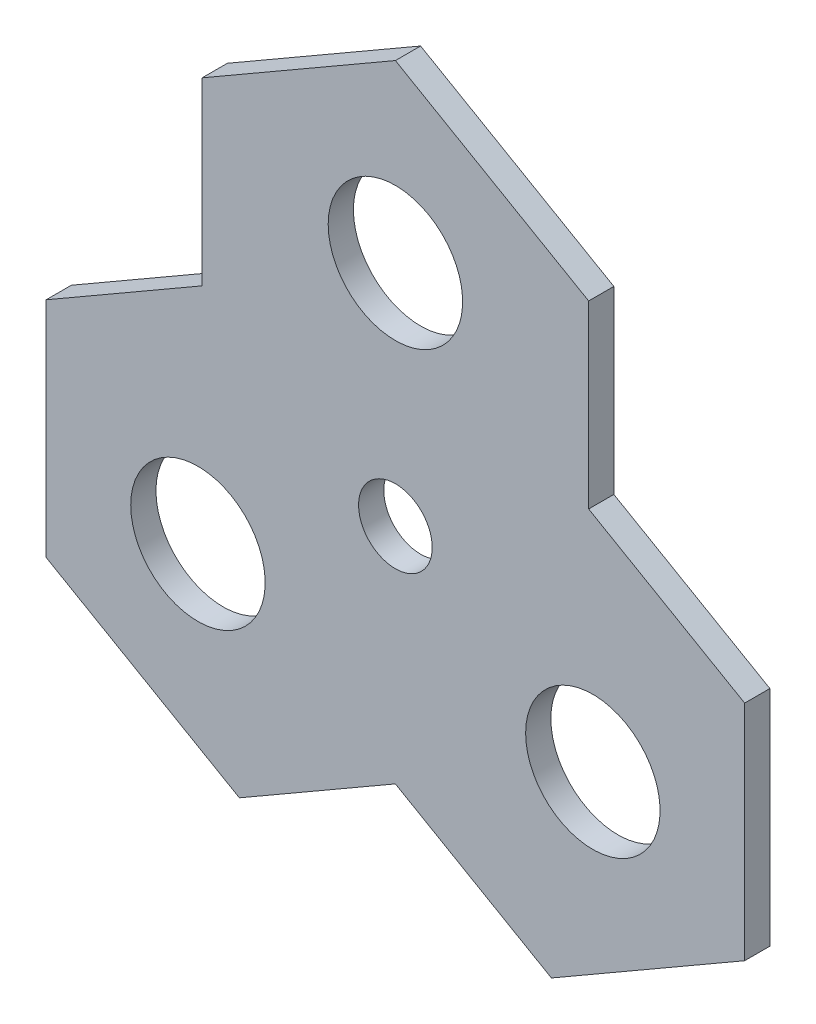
ISO-10303-21;
HEADER;
FILE_DESCRIPTION(('STEP AP214'),'2;1');
FILE_NAME('part.step','',(''),(''),'','','');
FILE_SCHEMA(('AUTOMOTIVE_DESIGN { 1 0 10303 214 1 1 1 1 }'));
ENDSEC;
DATA;
#1=APPLICATION_CONTEXT('core data for automotive mechanical design processes');
#2=APPLICATION_PROTOCOL_DEFINITION('international standard','automotive_design',2000,#1);
#3=PRODUCT_CONTEXT('',#1,'mechanical');
#4=PRODUCT('Part','Part','',(#3));
#5=PRODUCT_RELATED_PRODUCT_CATEGORY('part','',(#4));
#6=PRODUCT_DEFINITION_FORMATION('','',#4);
#7=PRODUCT_DEFINITION_CONTEXT('part definition',#1,'design');
#8=PRODUCT_DEFINITION('design','',#6,#7);
#9=PRODUCT_DEFINITION_SHAPE('','',#8);
#10=(LENGTH_UNIT() NAMED_UNIT(*) SI_UNIT(.MILLI.,.METRE.));
#11=(NAMED_UNIT(*) PLANE_ANGLE_UNIT() SI_UNIT($,.RADIAN.));
#12=(NAMED_UNIT(*) SI_UNIT($,.STERADIAN.) SOLID_ANGLE_UNIT());
#13=UNCERTAINTY_MEASURE_WITH_UNIT(LENGTH_MEASURE(1.E-05),#10,'distance_accuracy_value','');
#14=(GEOMETRIC_REPRESENTATION_CONTEXT(3) GLOBAL_UNCERTAINTY_ASSIGNED_CONTEXT((#13)) GLOBAL_UNIT_ASSIGNED_CONTEXT((#10,
#11,#12)) REPRESENTATION_CONTEXT('',''));
#15=CARTESIAN_POINT('',(0.,0.,0.));
#16=DIRECTION('',(0.,0.,1.));
#17=DIRECTION('',(1.,0.,0.));
#18=AXIS2_PLACEMENT_3D('',#15,#16,#17);
#19=CARTESIAN_POINT('',(-36.5125000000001,63.2415051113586,9.525));
#20=DIRECTION('',(-0.500000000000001,0.866025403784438,0.));
#21=DIRECTION('',(-0.866025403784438,-0.500000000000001,0.));
#22=AXIS2_PLACEMENT_3D('',#19,#20,#21);
#23=PLANE('',#22);
#24=DIRECTION('',(0.866025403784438,0.500000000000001,0.));
#25=VECTOR('',#24,1.);
#26=CARTESIAN_POINT('',(-36.5125000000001,63.2415051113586,0.));
#27=LINE('',#26,#25);
#28=CARTESIAN_POINT('',(-131.982271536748,8.12200681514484,0.));
#29=VERTEX_POINT('',#28);
#30=CARTESIAN_POINT('',(-73.025,42.1610034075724,0.));
#31=VERTEX_POINT('',#30);
#32=EDGE_CURVE('E170',#29,#31,#27,.T.);
#33=ORIENTED_EDGE('',*,*,#32,.F.);
#34=DIRECTION('',(0.,0.,-1.));
#35=VECTOR('',#34,1.);
#36=CARTESIAN_POINT('',(-131.982271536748,8.12200681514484,9.525));
#37=LINE('',#36,#35);
#38=CARTESIAN_POINT('',(-131.982271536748,8.12200681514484,9.525));
#39=VERTEX_POINT('',#38);
#40=EDGE_CURVE('E11',#39,#29,#37,.T.);
#41=ORIENTED_EDGE('',*,*,#40,.F.);
#42=DIRECTION('',(0.866025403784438,0.500000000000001,0.));
#43=VECTOR('',#42,1.);
#44=CARTESIAN_POINT('',(-36.5125000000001,63.2415051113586,9.525));
#45=LINE('',#44,#43);
#46=CARTESIAN_POINT('',(-73.025,42.1610034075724,9.525));
#47=VERTEX_POINT('',#46);
#48=EDGE_CURVE('E432',#39,#47,#45,.T.);
#49=ORIENTED_EDGE('',*,*,#48,.T.);
#50=DIRECTION('',(0.,0.,-1.));
#51=VECTOR('',#50,1.);
#52=CARTESIAN_POINT('',(-73.025,42.1610034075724,9.525));
#53=LINE('',#52,#51);
#54=EDGE_CURVE('E101',#47,#31,#53,.T.);
#55=ORIENTED_EDGE('',*,*,#54,.T.);
#56=EDGE_LOOP('',(#33,#41,#49,#55));
#57=FACE_BOUND('',#56,.T.);
#58=ADVANCED_FACE('F37',(#57),#23,.T.);
#59=CARTESIAN_POINT('',(-131.982271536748,1.30330528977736E-13,9.525));
#60=DIRECTION('',(-1.,0.,0.));
#61=DIRECTION('',(0.,-1.,0.));
#62=AXIS2_PLACEMENT_3D('',#59,#60,#61);
#63=PLANE('',#62);
#64=DIRECTION('',(0.,1.,0.));
#65=VECTOR('',#64,1.);
#66=CARTESIAN_POINT('',(-131.982271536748,1.30330528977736E-13,0.));
#67=LINE('',#66,#65);
#68=CARTESIAN_POINT('',(-131.982271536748,-76.2000000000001,0.));
#69=VERTEX_POINT('',#68);
#70=EDGE_CURVE('E172',#69,#29,#67,.T.);
#71=ORIENTED_EDGE('',*,*,#70,.F.);
#72=DIRECTION('',(0.,0.,-1.));
#73=VECTOR('',#72,1.);
#74=CARTESIAN_POINT('',(-131.982271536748,-76.2000000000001,9.525));
#75=LINE('',#74,#73);
#76=CARTESIAN_POINT('',(-131.982271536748,-76.2000000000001,9.525));
#77=VERTEX_POINT('',#76);
#78=EDGE_CURVE('E46',#77,#69,#75,.T.);
#79=ORIENTED_EDGE('',*,*,#78,.F.);
#80=DIRECTION('',(0.,1.,0.));
#81=VECTOR('',#80,1.);
#82=CARTESIAN_POINT('',(-131.982271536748,1.30330528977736E-13,9.525));
#83=LINE('',#82,#81);
#84=EDGE_CURVE('E230',#77,#39,#83,.T.);
#85=ORIENTED_EDGE('',*,*,#84,.T.);
#86=ORIENTED_EDGE('',*,*,#40,.T.);
#87=EDGE_LOOP('',(#71,#79,#85,#86));
#88=FACE_BOUND('',#87,.T.);
#89=ADVANCED_FACE('F229',(#88),#63,.T.);
#90=CARTESIAN_POINT('',(-65.991135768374,-114.3,9.525));
#91=DIRECTION('',(0.499999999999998,0.86602540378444,0.));
#92=DIRECTION('',(-0.86602540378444,0.499999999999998,0.));
#93=AXIS2_PLACEMENT_3D('',#90,#91,#92);
#94=PLANE('',#93);
#95=DIRECTION('',(0.86602540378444,-0.499999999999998,0.));
#96=VECTOR('',#95,1.);
#97=CARTESIAN_POINT('',(-65.991135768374,-114.3,0.));
#98=LINE('',#97,#96);
#99=CARTESIAN_POINT('',(-58.9572715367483,-118.361003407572,0.));
#100=VERTEX_POINT('',#99);
#101=EDGE_CURVE('E175',#69,#100,#98,.T.);
#102=ORIENTED_EDGE('',*,*,#101,.T.);
#103=DIRECTION('',(0.,0.,-1.));
#104=VECTOR('',#103,1.);
#105=CARTESIAN_POINT('',(-58.9572715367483,-118.361003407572,9.525));
#106=LINE('',#105,#104);
#107=CARTESIAN_POINT('',(-58.9572715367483,-118.361003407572,9.525));
#108=VERTEX_POINT('',#107);
#109=EDGE_CURVE('E215',#108,#100,#106,.T.);
#110=ORIENTED_EDGE('',*,*,#109,.F.);
#111=DIRECTION('',(0.86602540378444,-0.499999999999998,0.));
#112=VECTOR('',#111,1.);
#113=CARTESIAN_POINT('',(-65.991135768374,-114.3,9.525));
#114=LINE('',#113,#112);
#115=EDGE_CURVE('E223',#77,#108,#114,.T.);
#116=ORIENTED_EDGE('',*,*,#115,.F.);
#117=ORIENTED_EDGE('',*,*,#78,.T.);
#118=EDGE_LOOP('',(#102,#110,#116,#117));
#119=FACE_BOUND('',#118,.T.);
#120=ADVANCED_FACE('F220',(#119),#94,.F.);
#121=CARTESIAN_POINT('',(36.5125,-63.2415051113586,9.525));
#122=DIRECTION('',(-0.500000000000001,0.866025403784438,0.));
#123=DIRECTION('',(-0.866025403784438,-0.500000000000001,0.));
#124=AXIS2_PLACEMENT_3D('',#121,#122,#123);
#125=PLANE('',#124);
#126=DIRECTION('',(0.866025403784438,0.5,0.));
#127=VECTOR('',#126,1.);
#128=CARTESIAN_POINT('',(36.5125,-63.2415051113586,0.));
#129=LINE('',#128,#127);
#130=CARTESIAN_POINT('',(0.,-84.3220068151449,0.));
#131=VERTEX_POINT('',#130);
#132=EDGE_CURVE('E178',#100,#131,#129,.T.);
#133=ORIENTED_EDGE('',*,*,#132,.T.);
#134=DIRECTION('',(0.,0.,-1.));
#135=VECTOR('',#134,1.);
#136=CARTESIAN_POINT('',(0.,-84.3220068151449,9.525));
#137=LINE('',#136,#135);
#138=CARTESIAN_POINT('',(0.,-84.3220068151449,9.525));
#139=VERTEX_POINT('',#138);
#140=EDGE_CURVE('E213',#139,#131,#137,.T.);
#141=ORIENTED_EDGE('',*,*,#140,.F.);
#142=DIRECTION('',(0.866025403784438,0.5,0.));
#143=VECTOR('',#142,1.);
#144=CARTESIAN_POINT('',(36.5125,-63.2415051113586,9.525));
#145=LINE('',#144,#143);
#146=EDGE_CURVE('E418',#108,#139,#145,.T.);
#147=ORIENTED_EDGE('',*,*,#146,.F.);
#148=ORIENTED_EDGE('',*,*,#109,.T.);
#149=EDGE_LOOP('',(#133,#141,#147,#148));
#150=FACE_BOUND('',#149,.T.);
#151=ADVANCED_FACE('F301',(#150),#125,.F.);
#152=CARTESIAN_POINT('',(-36.5125,-63.2415051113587,9.525));
#153=DIRECTION('',(-0.499999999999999,-0.866025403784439,0.));
#154=DIRECTION('',(0.866025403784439,-0.499999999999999,0.));
#155=AXIS2_PLACEMENT_3D('',#152,#153,#154);
#156=PLANE('',#155);
#157=DIRECTION('',(-0.866025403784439,0.499999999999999,0.));
#158=VECTOR('',#157,1.);
#159=CARTESIAN_POINT('',(-36.5125,-63.2415051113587,0.));
#160=LINE('',#159,#158);
#161=CARTESIAN_POINT('',(58.9572715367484,-118.361003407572,0.));
#162=VERTEX_POINT('',#161);
#163=EDGE_CURVE('E181',#162,#131,#160,.T.);
#164=ORIENTED_EDGE('',*,*,#163,.F.);
#165=DIRECTION('',(0.,0.,-1.));
#166=VECTOR('',#165,1.);
#167=CARTESIAN_POINT('',(58.9572715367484,-118.361003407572,9.525));
#168=LINE('',#167,#166);
#169=CARTESIAN_POINT('',(58.9572715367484,-118.361003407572,9.525));
#170=VERTEX_POINT('',#169);
#171=EDGE_CURVE('E211',#170,#162,#168,.T.);
#172=ORIENTED_EDGE('',*,*,#171,.F.);
#173=DIRECTION('',(-0.866025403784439,0.499999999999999,0.));
#174=VECTOR('',#173,1.);
#175=CARTESIAN_POINT('',(-36.5125,-63.2415051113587,9.525));
#176=LINE('',#175,#174);
#177=EDGE_CURVE('E414',#170,#139,#176,.T.);
#178=ORIENTED_EDGE('',*,*,#177,.T.);
#179=ORIENTED_EDGE('',*,*,#140,.T.);
#180=EDGE_LOOP('',(#164,#172,#178,#179));
#181=FACE_BOUND('',#180,.T.);
#182=ADVANCED_FACE('F297',(#181),#156,.T.);
#183=CARTESIAN_POINT('',(65.9911357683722,-114.300000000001,9.525));
#184=DIRECTION('',(0.499999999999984,-0.866025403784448,0.));
#185=DIRECTION('',(0.866025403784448,0.499999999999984,0.));
#186=AXIS2_PLACEMENT_3D('',#183,#184,#185);
#187=PLANE('',#186);
#188=DIRECTION('',(-0.866025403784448,-0.499999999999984,0.));
#189=VECTOR('',#188,1.);
#190=CARTESIAN_POINT('',(65.9911357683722,-114.300000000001,0.));
#191=LINE('',#190,#189);
#192=CARTESIAN_POINT('',(131.982271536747,-76.2000000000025,0.));
#193=VERTEX_POINT('',#192);
#194=EDGE_CURVE('E184',#193,#162,#191,.T.);
#195=ORIENTED_EDGE('',*,*,#194,.F.);
#196=DIRECTION('',(0.,0.,-1.));
#197=VECTOR('',#196,1.);
#198=CARTESIAN_POINT('',(131.982271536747,-76.2000000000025,9.525));
#199=LINE('',#198,#197);
#200=CARTESIAN_POINT('',(131.982271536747,-76.2000000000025,9.525));
#201=VERTEX_POINT('',#200);
#202=EDGE_CURVE('E209',#201,#193,#199,.T.);
#203=ORIENTED_EDGE('',*,*,#202,.F.);
#204=DIRECTION('',(-0.866025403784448,-0.499999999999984,0.));
#205=VECTOR('',#204,1.);
#206=CARTESIAN_POINT('',(65.9911357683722,-114.300000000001,9.525));
#207=LINE('',#206,#205);
#208=EDGE_CURVE('E417',#201,#170,#207,.T.);
#209=ORIENTED_EDGE('',*,*,#208,.T.);
#210=ORIENTED_EDGE('',*,*,#171,.T.);
#211=EDGE_LOOP('',(#195,#203,#209,#210));
#212=FACE_BOUND('',#211,.T.);
#213=ADVANCED_FACE('F293',(#212),#187,.T.);
#214=CARTESIAN_POINT('',(131.982271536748,-2.04184495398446E-12,9.525));
#215=DIRECTION('',(-1.,0.,0.));
#216=DIRECTION('',(0.,-1.,0.));
#217=AXIS2_PLACEMENT_3D('',#214,#215,#216);
#218=PLANE('',#217);
#219=DIRECTION('',(0.,1.,0.));
#220=VECTOR('',#219,1.);
#221=CARTESIAN_POINT('',(131.982271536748,-2.04184495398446E-12,0.));
#222=LINE('',#221,#220);
#223=CARTESIAN_POINT('',(131.982271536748,8.12200681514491,0.));
#224=VERTEX_POINT('',#223);
#225=EDGE_CURVE('E187',#193,#224,#222,.T.);
#226=ORIENTED_EDGE('',*,*,#225,.T.);
#227=DIRECTION('',(0.,0.,-1.));
#228=VECTOR('',#227,1.);
#229=CARTESIAN_POINT('',(131.982271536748,8.12200681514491,9.525));
#230=LINE('',#229,#228);
#231=CARTESIAN_POINT('',(131.982271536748,8.12200681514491,9.525));
#232=VERTEX_POINT('',#231);
#233=EDGE_CURVE('E206',#232,#224,#230,.T.);
#234=ORIENTED_EDGE('',*,*,#233,.F.);
#235=DIRECTION('',(0.,1.,0.));
#236=VECTOR('',#235,1.);
#237=CARTESIAN_POINT('',(131.982271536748,-2.04184495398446E-12,9.525));
#238=LINE('',#237,#236);
#239=EDGE_CURVE('E420',#201,#232,#238,.T.);
#240=ORIENTED_EDGE('',*,*,#239,.F.);
#241=ORIENTED_EDGE('',*,*,#202,.T.);
#242=EDGE_LOOP('',(#226,#234,#240,#241));
#243=FACE_BOUND('',#242,.T.);
#244=ADVANCED_FACE('F289',(#243),#218,.F.);
#245=CARTESIAN_POINT('',(36.5125,63.2415051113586,9.525));
#246=DIRECTION('',(-0.5,-0.866025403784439,0.));
#247=DIRECTION('',(0.866025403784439,-0.5,0.));
#248=AXIS2_PLACEMENT_3D('',#245,#246,#247);
#249=PLANE('',#248);
#250=DIRECTION('',(-0.866025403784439,0.5,0.));
#251=VECTOR('',#250,1.);
#252=CARTESIAN_POINT('',(36.5125,63.2415051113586,0.));
#253=LINE('',#252,#251);
#254=CARTESIAN_POINT('',(73.025,42.1610034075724,0.));
#255=VERTEX_POINT('',#254);
#256=EDGE_CURVE('E190',#224,#255,#253,.T.);
#257=ORIENTED_EDGE('',*,*,#256,.T.);
#258=DIRECTION('',(0.,0.,-1.));
#259=VECTOR('',#258,1.);
#260=CARTESIAN_POINT('',(73.025,42.1610034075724,9.525));
#261=LINE('',#260,#259);
#262=CARTESIAN_POINT('',(73.025,42.1610034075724,9.525));
#263=VERTEX_POINT('',#262);
#264=EDGE_CURVE('E204',#263,#255,#261,.T.);
#265=ORIENTED_EDGE('',*,*,#264,.F.);
#266=DIRECTION('',(-0.866025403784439,0.5,0.));
#267=VECTOR('',#266,1.);
#268=CARTESIAN_POINT('',(36.5125,63.2415051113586,9.525));
#269=LINE('',#268,#267);
#270=EDGE_CURVE('E153',#232,#263,#269,.T.);
#271=ORIENTED_EDGE('',*,*,#270,.F.);
#272=ORIENTED_EDGE('',*,*,#233,.T.);
#273=EDGE_LOOP('',(#257,#265,#271,#272));
#274=FACE_BOUND('',#273,.T.);
#275=ADVANCED_FACE('F285',(#274),#249,.F.);
#276=CARTESIAN_POINT('',(73.0250000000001,0.,9.525));
#277=DIRECTION('',(1.,0.,0.));
#278=DIRECTION('',(0.,1.,0.));
#279=AXIS2_PLACEMENT_3D('',#276,#277,#278);
#280=PLANE('',#279);
#281=DIRECTION('',(0.,-1.,0.));
#282=VECTOR('',#281,1.);
#283=CARTESIAN_POINT('',(73.0250000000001,0.,0.));
#284=LINE('',#283,#282);
#285=CARTESIAN_POINT('',(73.025,110.238996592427,0.));
#286=VERTEX_POINT('',#285);
#287=EDGE_CURVE('E193',#286,#255,#284,.T.);
#288=ORIENTED_EDGE('',*,*,#287,.F.);
#289=DIRECTION('',(0.,0.,-1.));
#290=VECTOR('',#289,1.);
#291=CARTESIAN_POINT('',(73.025,110.238996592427,9.525));
#292=LINE('',#291,#290);
#293=CARTESIAN_POINT('',(73.025,110.238996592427,9.525));
#294=VERTEX_POINT('',#293);
#295=EDGE_CURVE('E141',#294,#286,#292,.T.);
#296=ORIENTED_EDGE('',*,*,#295,.F.);
#297=DIRECTION('',(0.,-1.,0.));
#298=VECTOR('',#297,1.);
#299=CARTESIAN_POINT('',(73.0250000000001,0.,9.525));
#300=LINE('',#299,#298);
#301=EDGE_CURVE('E151',#294,#263,#300,.T.);
#302=ORIENTED_EDGE('',*,*,#301,.T.);
#303=ORIENTED_EDGE('',*,*,#264,.T.);
#304=EDGE_LOOP('',(#288,#296,#302,#303));
#305=FACE_BOUND('',#304,.T.);
#306=ADVANCED_FACE('F282',(#305),#280,.T.);
#307=CARTESIAN_POINT('',(65.9911357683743,114.3,9.525));
#308=DIRECTION('',(0.500000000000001,0.866025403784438,0.));
#309=DIRECTION('',(-0.866025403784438,0.500000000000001,0.));
#310=AXIS2_PLACEMENT_3D('',#307,#308,#309);
#311=PLANE('',#310);
#312=DIRECTION('',(0.866025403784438,-0.500000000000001,0.));
#313=VECTOR('',#312,1.);
#314=CARTESIAN_POINT('',(65.9911357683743,114.3,0.));
#315=LINE('',#314,#313);
#316=CARTESIAN_POINT('',(0.,152.4,0.));
#317=VERTEX_POINT('',#316);
#318=EDGE_CURVE('E138',#317,#286,#315,.T.);
#319=ORIENTED_EDGE('',*,*,#318,.F.);
#320=DIRECTION('',(0.,0.,-1.));
#321=VECTOR('',#320,1.);
#322=CARTESIAN_POINT('',(0.,152.4,9.525));
#323=LINE('',#322,#321);
#324=CARTESIAN_POINT('',(0.,152.4,9.525));
#325=VERTEX_POINT('',#324);
#326=EDGE_CURVE('E132',#325,#317,#323,.T.);
#327=ORIENTED_EDGE('',*,*,#326,.F.);
#328=DIRECTION('',(0.866025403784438,-0.500000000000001,0.));
#329=VECTOR('',#328,1.);
#330=CARTESIAN_POINT('',(65.9911357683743,114.3,9.525));
#331=LINE('',#330,#329);
#332=EDGE_CURVE('E136',#325,#294,#331,.T.);
#333=ORIENTED_EDGE('',*,*,#332,.T.);
#334=ORIENTED_EDGE('',*,*,#295,.T.);
#335=EDGE_LOOP('',(#319,#327,#333,#334));
#336=FACE_BOUND('',#335,.T.);
#337=ADVANCED_FACE('F134',(#336),#311,.T.);
#338=CARTESIAN_POINT('',(-65.9911357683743,114.3,9.525));
#339=DIRECTION('',(0.500000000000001,-0.866025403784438,0.));
#340=DIRECTION('',(0.866025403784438,0.500000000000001,0.));
#341=AXIS2_PLACEMENT_3D('',#338,#339,#340);
#342=PLANE('',#341);
#343=DIRECTION('',(-0.866025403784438,-0.500000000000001,0.));
#344=VECTOR('',#343,1.);
#345=CARTESIAN_POINT('',(-65.9911357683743,114.3,0.));
#346=LINE('',#345,#344);
#347=CARTESIAN_POINT('',(-73.025,110.238996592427,0.));
#348=VERTEX_POINT('',#347);
#349=EDGE_CURVE('E197',#317,#348,#346,.T.);
#350=ORIENTED_EDGE('',*,*,#349,.T.);
#351=DIRECTION('',(0.,0.,-1.));
#352=VECTOR('',#351,1.);
#353=CARTESIAN_POINT('',(-73.025,110.238996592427,9.525));
#354=LINE('',#353,#352);
#355=CARTESIAN_POINT('',(-73.025,110.238996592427,9.525));
#356=VERTEX_POINT('',#355);
#357=EDGE_CURVE('E142',#356,#348,#354,.T.);
#358=ORIENTED_EDGE('',*,*,#357,.F.);
#359=DIRECTION('',(-0.866025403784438,-0.500000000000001,0.));
#360=VECTOR('',#359,1.);
#361=CARTESIAN_POINT('',(-65.9911357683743,114.3,9.525));
#362=LINE('',#361,#360);
#363=EDGE_CURVE('E145',#325,#356,#362,.T.);
#364=ORIENTED_EDGE('',*,*,#363,.F.);
#365=ORIENTED_EDGE('',*,*,#326,.T.);
#366=EDGE_LOOP('',(#350,#358,#364,#365));
#367=FACE_BOUND('',#366,.T.);
#368=ADVANCED_FACE('F146',(#367),#342,.F.);
#369=CARTESIAN_POINT('',(0.,0.,9.525));
#370=DIRECTION('',(0.,0.,-1.));
#371=DIRECTION('',(-1.,0.,0.));
#372=AXIS2_PLACEMENT_3D('',#369,#370,#371);
#373=CYLINDRICAL_SURFACE('',#372,13.9189314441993);
#374=CARTESIAN_POINT('',(0.,0.,9.525));
#375=DIRECTION('',(0.,0.,1.));
#376=DIRECTION('',(1.,0.,0.));
#377=AXIS2_PLACEMENT_3D('',#374,#375,#376);
#378=CIRCLE('',#377,13.9189314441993);
#379=CARTESIAN_POINT('',(-13.9189314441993,0.,9.525));
#380=VERTEX_POINT('',#379);
#381=EDGE_CURVE('E434',#380,#380,#378,.T.);
#382=CARTESIAN_POINT('',(0.,0.,0.));
#383=DIRECTION('',(0.,0.,1.));
#384=DIRECTION('',(1.,0.,0.));
#385=AXIS2_PLACEMENT_3D('',#382,#383,#384);
#386=CIRCLE('',#385,13.9189314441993);
#387=CARTESIAN_POINT('',(-13.9189314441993,0.,0.));
#388=VERTEX_POINT('',#387);
#389=EDGE_CURVE('E167',#388,#388,#386,.T.);
#390=CARTESIAN_POINT('',(-13.9189314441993,0.,9.525));
#391=CARTESIAN_POINT('',(-13.9189314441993,0.,9.42578125));
#392=CARTESIAN_POINT('',(-13.9189314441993,0.,9.3265625));
#393=CARTESIAN_POINT('',(-13.9189314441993,0.,9.128125));
#394=CARTESIAN_POINT('',(-13.9189314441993,0.,9.02890625));
#395=CARTESIAN_POINT('',(-13.9189314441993,0.,8.83046875));
#396=CARTESIAN_POINT('',(-13.9189314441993,0.,8.73125));
#397=CARTESIAN_POINT('',(-13.9189314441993,0.,8.5328125));
#398=CARTESIAN_POINT('',(-13.9189314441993,0.,8.43359375));
#399=CARTESIAN_POINT('',(-13.9189314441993,0.,8.23515625));
#400=CARTESIAN_POINT('',(-13.9189314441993,0.,8.1359375));
#401=CARTESIAN_POINT('',(-13.9189314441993,0.,7.9375));
#402=CARTESIAN_POINT('',(-13.9189314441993,0.,7.83828125));
#403=CARTESIAN_POINT('',(-13.9189314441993,0.,7.63984375));
#404=CARTESIAN_POINT('',(-13.9189314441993,0.,7.540625));
#405=CARTESIAN_POINT('',(-13.9189314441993,0.,7.3421875));
#406=CARTESIAN_POINT('',(-13.9189314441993,0.,7.24296875));
#407=CARTESIAN_POINT('',(-13.9189314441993,0.,7.04453125));
#408=CARTESIAN_POINT('',(-13.9189314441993,0.,6.9453125));
#409=CARTESIAN_POINT('',(-13.9189314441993,0.,6.746875));
#410=CARTESIAN_POINT('',(-13.9189314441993,0.,6.64765625));
#411=CARTESIAN_POINT('',(-13.9189314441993,0.,6.44921875));
#412=CARTESIAN_POINT('',(-13.9189314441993,0.,6.35));
#413=CARTESIAN_POINT('',(-13.9189314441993,0.,6.1515625));
#414=CARTESIAN_POINT('',(-13.9189314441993,0.,6.05234375));
#415=CARTESIAN_POINT('',(-13.9189314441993,0.,5.85390625));
#416=CARTESIAN_POINT('',(-13.9189314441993,0.,5.7546875));
#417=CARTESIAN_POINT('',(-13.9189314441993,0.,5.55625));
#418=CARTESIAN_POINT('',(-13.9189314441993,0.,5.45703125));
#419=CARTESIAN_POINT('',(-13.9189314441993,0.,5.25859375));
#420=CARTESIAN_POINT('',(-13.9189314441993,0.,5.159375));
#421=CARTESIAN_POINT('',(-13.9189314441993,0.,4.9609375));
#422=CARTESIAN_POINT('',(-13.9189314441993,0.,4.86171875));
#423=CARTESIAN_POINT('',(-13.9189314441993,0.,4.66328125));
#424=CARTESIAN_POINT('',(-13.9189314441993,0.,4.5640625));
#425=CARTESIAN_POINT('',(-13.9189314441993,0.,4.365625));
#426=CARTESIAN_POINT('',(-13.9189314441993,0.,4.26640625));
#427=CARTESIAN_POINT('',(-13.9189314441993,0.,4.06796875));
#428=CARTESIAN_POINT('',(-13.9189314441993,0.,3.96875));
#429=CARTESIAN_POINT('',(-13.9189314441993,0.,3.7703125));
#430=CARTESIAN_POINT('',(-13.9189314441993,0.,3.67109375));
#431=CARTESIAN_POINT('',(-13.9189314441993,0.,3.47265625));
#432=CARTESIAN_POINT('',(-13.9189314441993,0.,3.3734375));
#433=CARTESIAN_POINT('',(-13.9189314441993,0.,3.175));
#434=CARTESIAN_POINT('',(-13.9189314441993,0.,3.07578125));
#435=CARTESIAN_POINT('',(-13.9189314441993,0.,2.87734375));
#436=CARTESIAN_POINT('',(-13.9189314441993,0.,2.778125));
#437=CARTESIAN_POINT('',(-13.9189314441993,0.,2.5796875));
#438=CARTESIAN_POINT('',(-13.9189314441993,0.,2.48046875));
#439=CARTESIAN_POINT('',(-13.9189314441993,0.,2.28203125));
#440=CARTESIAN_POINT('',(-13.9189314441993,0.,2.1828125));
#441=CARTESIAN_POINT('',(-13.9189314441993,0.,1.984375));
#442=CARTESIAN_POINT('',(-13.9189314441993,0.,1.88515625));
#443=CARTESIAN_POINT('',(-13.9189314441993,0.,1.68671875));
#444=CARTESIAN_POINT('',(-13.9189314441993,0.,1.5875));
#445=CARTESIAN_POINT('',(-13.9189314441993,0.,1.3890625));
#446=CARTESIAN_POINT('',(-13.9189314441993,0.,1.28984375));
#447=CARTESIAN_POINT('',(-13.9189314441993,0.,1.09140625));
#448=CARTESIAN_POINT('',(-13.9189314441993,0.,0.992187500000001));
#449=CARTESIAN_POINT('',(-13.9189314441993,0.,0.793750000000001));
#450=CARTESIAN_POINT('',(-13.9189314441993,0.,0.69453125));
#451=CARTESIAN_POINT('',(-13.9189314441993,0.,0.49609375));
#452=CARTESIAN_POINT('',(-13.9189314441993,0.,0.396875));
#453=CARTESIAN_POINT('',(-13.9189314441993,0.,0.1984375));
#454=CARTESIAN_POINT('',(-13.9189314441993,0.,0.0992187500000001));
#455=CARTESIAN_POINT('',(-13.9189314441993,0.,0.));
#456=B_SPLINE_CURVE_WITH_KNOTS('',3,(#390,#391,#392,#393,#394,#395,#396,#397,#398,#399,#400,
#401,#402,#403,#404,#405,#406,#407,#408,#409,#410,#411,#412,#413,#414,#415,#416,#417,#418,#419,
#420,#421,#422,#423,#424,#425,#426,#427,#428,#429,#430,#431,#432,#433,#434,#435,#436,#437,#438,
#439,#440,#441,#442,#443,#444,#445,#446,#447,#448,#449,#450,#451,#452,#453,#454,#455),
.UNSPECIFIED.,.F.,.F.,(4,2,2,2,2,2,2,2,2,2,2,2,2,2,2,2,2,2,2,2,2,2,2,2,2,2,2,2,2,2,2,2,4),(0.,
0.29765625,0.5953125,0.892968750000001,1.190625,1.48828125,1.7859375,2.08359375,2.38125,
2.67890625,2.9765625,3.27421875,3.571875,3.86953125,4.1671875,4.46484375,4.7625,5.06015625,
5.3578125,5.65546875,5.953125,6.25078125,6.5484375,6.84609375,7.14375,7.44140625,7.7390625,
8.03671875,8.334375,8.63203125,8.9296875,9.22734375,9.525),.UNSPECIFIED.);
#457=EDGE_CURVE('BSEAM239',#380,#388,#456,.T.);
#458=ORIENTED_EDGE('',*,*,#381,.T.);
#459=ORIENTED_EDGE('',*,*,#389,.F.);
#460=ORIENTED_EDGE('',*,*,#457,.T.);
#461=ORIENTED_EDGE('',*,*,#457,.F.);
#462=EDGE_LOOP('',(#458,#460,#459,#461));
#463=FACE_BOUND('',#462,.T.);
#464=ADVANCED_FACE('F239',(#463),#373,.F.);
#465=CARTESIAN_POINT('',(0.,86.1550939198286,9.525));
#466=DIRECTION('',(0.,0.,-1.));
#467=DIRECTION('',(-1.,0.,0.));
#468=AXIS2_PLACEMENT_3D('',#465,#466,#467);
#469=CYLINDRICAL_SURFACE('',#468,25.399999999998);
#470=CARTESIAN_POINT('',(0.,86.1550939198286,9.525));
#471=DIRECTION('',(0.,0.,1.));
#472=DIRECTION('',(1.,0.,0.));
#473=AXIS2_PLACEMENT_3D('',#470,#471,#472);
#474=CIRCLE('',#473,25.399999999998);
#475=CARTESIAN_POINT('',(-25.399999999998,86.1550939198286,9.525));
#476=VERTEX_POINT('',#475);
#477=EDGE_CURVE('E437',#476,#476,#474,.T.);
#478=CARTESIAN_POINT('',(0.,86.1550939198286,0.));
#479=DIRECTION('',(0.,0.,1.));
#480=DIRECTION('',(1.,0.,0.));
#481=AXIS2_PLACEMENT_3D('',#478,#479,#480);
#482=CIRCLE('',#481,25.399999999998);
#483=CARTESIAN_POINT('',(-25.399999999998,86.1550939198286,0.));
#484=VERTEX_POINT('',#483);
#485=EDGE_CURVE('E164',#484,#484,#482,.T.);
#486=CARTESIAN_POINT('',(-25.399999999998,86.1550939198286,9.525));
#487=CARTESIAN_POINT('',(-25.399999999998,86.1550939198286,9.42578125));
#488=CARTESIAN_POINT('',(-25.399999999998,86.1550939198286,9.3265625));
#489=CARTESIAN_POINT('',(-25.399999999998,86.1550939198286,9.128125));
#490=CARTESIAN_POINT('',(-25.399999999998,86.1550939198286,9.02890625));
#491=CARTESIAN_POINT('',(-25.399999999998,86.1550939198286,8.83046875));
#492=CARTESIAN_POINT('',(-25.399999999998,86.1550939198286,8.73125));
#493=CARTESIAN_POINT('',(-25.399999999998,86.1550939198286,8.5328125));
#494=CARTESIAN_POINT('',(-25.399999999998,86.1550939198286,8.43359375));
#495=CARTESIAN_POINT('',(-25.399999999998,86.1550939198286,8.23515625));
#496=CARTESIAN_POINT('',(-25.399999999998,86.1550939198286,8.1359375));
#497=CARTESIAN_POINT('',(-25.399999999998,86.1550939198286,7.9375));
#498=CARTESIAN_POINT('',(-25.399999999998,86.1550939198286,7.83828125));
#499=CARTESIAN_POINT('',(-25.399999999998,86.1550939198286,7.63984375));
#500=CARTESIAN_POINT('',(-25.399999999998,86.1550939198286,7.540625));
#501=CARTESIAN_POINT('',(-25.399999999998,86.1550939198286,7.3421875));
#502=CARTESIAN_POINT('',(-25.399999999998,86.1550939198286,7.24296875));
#503=CARTESIAN_POINT('',(-25.399999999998,86.1550939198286,7.04453125));
#504=CARTESIAN_POINT('',(-25.399999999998,86.1550939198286,6.9453125));
#505=CARTESIAN_POINT('',(-25.399999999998,86.1550939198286,6.746875));
#506=CARTESIAN_POINT('',(-25.399999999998,86.1550939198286,6.64765625));
#507=CARTESIAN_POINT('',(-25.399999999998,86.1550939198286,6.44921875));
#508=CARTESIAN_POINT('',(-25.399999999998,86.1550939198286,6.35));
#509=CARTESIAN_POINT('',(-25.399999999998,86.1550939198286,6.1515625));
#510=CARTESIAN_POINT('',(-25.399999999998,86.1550939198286,6.05234375));
#511=CARTESIAN_POINT('',(-25.399999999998,86.1550939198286,5.85390625));
#512=CARTESIAN_POINT('',(-25.399999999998,86.1550939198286,5.7546875));
#513=CARTESIAN_POINT('',(-25.399999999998,86.1550939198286,5.55625));
#514=CARTESIAN_POINT('',(-25.399999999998,86.1550939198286,5.45703125));
#515=CARTESIAN_POINT('',(-25.399999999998,86.1550939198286,5.25859375));
#516=CARTESIAN_POINT('',(-25.399999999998,86.1550939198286,5.159375));
#517=CARTESIAN_POINT('',(-25.399999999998,86.1550939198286,4.9609375));
#518=CARTESIAN_POINT('',(-25.399999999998,86.1550939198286,4.86171875));
#519=CARTESIAN_POINT('',(-25.399999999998,86.1550939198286,4.66328125));
#520=CARTESIAN_POINT('',(-25.399999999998,86.1550939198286,4.5640625));
#521=CARTESIAN_POINT('',(-25.399999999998,86.1550939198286,4.365625));
#522=CARTESIAN_POINT('',(-25.399999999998,86.1550939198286,4.26640625));
#523=CARTESIAN_POINT('',(-25.399999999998,86.1550939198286,4.06796875));
#524=CARTESIAN_POINT('',(-25.399999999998,86.1550939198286,3.96875));
#525=CARTESIAN_POINT('',(-25.399999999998,86.1550939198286,3.7703125));
#526=CARTESIAN_POINT('',(-25.399999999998,86.1550939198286,3.67109375));
#527=CARTESIAN_POINT('',(-25.399999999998,86.1550939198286,3.47265625));
#528=CARTESIAN_POINT('',(-25.399999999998,86.1550939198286,3.3734375));
#529=CARTESIAN_POINT('',(-25.399999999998,86.1550939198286,3.175));
#530=CARTESIAN_POINT('',(-25.399999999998,86.1550939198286,3.07578125));
#531=CARTESIAN_POINT('',(-25.399999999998,86.1550939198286,2.87734375));
#532=CARTESIAN_POINT('',(-25.399999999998,86.1550939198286,2.778125));
#533=CARTESIAN_POINT('',(-25.399999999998,86.1550939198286,2.5796875));
#534=CARTESIAN_POINT('',(-25.399999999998,86.1550939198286,2.48046875));
#535=CARTESIAN_POINT('',(-25.399999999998,86.1550939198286,2.28203125));
#536=CARTESIAN_POINT('',(-25.399999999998,86.1550939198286,2.1828125));
#537=CARTESIAN_POINT('',(-25.399999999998,86.1550939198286,1.984375));
#538=CARTESIAN_POINT('',(-25.399999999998,86.1550939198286,1.88515625));
#539=CARTESIAN_POINT('',(-25.399999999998,86.1550939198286,1.68671875));
#540=CARTESIAN_POINT('',(-25.399999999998,86.1550939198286,1.5875));
#541=CARTESIAN_POINT('',(-25.399999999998,86.1550939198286,1.3890625));
#542=CARTESIAN_POINT('',(-25.399999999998,86.1550939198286,1.28984375));
#543=CARTESIAN_POINT('',(-25.399999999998,86.1550939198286,1.09140625));
#544=CARTESIAN_POINT('',(-25.399999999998,86.1550939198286,0.992187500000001));
#545=CARTESIAN_POINT('',(-25.399999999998,86.1550939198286,0.793750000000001));
#546=CARTESIAN_POINT('',(-25.399999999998,86.1550939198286,0.69453125));
#547=CARTESIAN_POINT('',(-25.399999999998,86.1550939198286,0.49609375));
#548=CARTESIAN_POINT('',(-25.399999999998,86.1550939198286,0.396875));
#549=CARTESIAN_POINT('',(-25.399999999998,86.1550939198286,0.1984375));
#550=CARTESIAN_POINT('',(-25.399999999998,86.1550939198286,0.0992187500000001));
#551=CARTESIAN_POINT('',(-25.399999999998,86.1550939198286,0.));
#552=B_SPLINE_CURVE_WITH_KNOTS('',3,(#486,#487,#488,#489,#490,#491,#492,#493,#494,#495,#496,
#497,#498,#499,#500,#501,#502,#503,#504,#505,#506,#507,#508,#509,#510,#511,#512,#513,#514,#515,
#516,#517,#518,#519,#520,#521,#522,#523,#524,#525,#526,#527,#528,#529,#530,#531,#532,#533,#534,
#535,#536,#537,#538,#539,#540,#541,#542,#543,#544,#545,#546,#547,#548,#549,#550,#551),
.UNSPECIFIED.,.F.,.F.,(4,2,2,2,2,2,2,2,2,2,2,2,2,2,2,2,2,2,2,2,2,2,2,2,2,2,2,2,2,2,2,2,4),(0.,
0.297656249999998,0.595312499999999,0.892968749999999,1.190625,1.48828125,1.7859375,2.08359375,
2.38125,2.67890625,2.9765625,3.27421875,3.571875,3.86953125,4.1671875,4.46484375,4.7625,
5.06015625,5.3578125,5.65546875,5.953125,6.25078125,6.5484375,6.84609375,7.14375,7.44140625,
7.7390625,8.03671875,8.334375,8.63203125,8.9296875,9.22734375,9.525),.UNSPECIFIED.);
#553=EDGE_CURVE('BSEAM242',#476,#484,#552,.T.);
#554=ORIENTED_EDGE('',*,*,#477,.T.);
#555=ORIENTED_EDGE('',*,*,#485,.F.);
#556=ORIENTED_EDGE('',*,*,#553,.T.);
#557=ORIENTED_EDGE('',*,*,#553,.F.);
#558=EDGE_LOOP('',(#554,#556,#555,#557));
#559=FACE_BOUND('',#558,.T.);
#560=ADVANCED_FACE('F242',(#559),#469,.F.);
#561=CARTESIAN_POINT('',(74.6125000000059,-43.0775469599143,9.525));
#562=DIRECTION('',(0.,0.,-1.));
#563=DIRECTION('',(-1.,0.,0.));
#564=AXIS2_PLACEMENT_3D('',#561,#562,#563);
#565=CYLINDRICAL_SURFACE('',#564,25.4000000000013);
#566=CARTESIAN_POINT('',(74.6125000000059,-43.0775469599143,9.525));
#567=DIRECTION('',(0.,0.,1.));
#568=DIRECTION('',(1.,0.,0.));
#569=AXIS2_PLACEMENT_3D('',#566,#567,#568);
#570=CIRCLE('',#569,25.4000000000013);
#571=CARTESIAN_POINT('',(49.2125000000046,-43.0775469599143,9.525));
#572=VERTEX_POINT('',#571);
#573=EDGE_CURVE('E257',#572,#572,#570,.T.);
#574=CARTESIAN_POINT('',(74.6125000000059,-43.0775469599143,0.));
#575=DIRECTION('',(0.,0.,1.));
#576=DIRECTION('',(1.,0.,0.));
#577=AXIS2_PLACEMENT_3D('',#574,#575,#576);
#578=CIRCLE('',#577,25.4000000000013);
#579=CARTESIAN_POINT('',(49.2125000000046,-43.0775469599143,0.));
#580=VERTEX_POINT('',#579);
#581=EDGE_CURVE('E161',#580,#580,#578,.T.);
#582=CARTESIAN_POINT('',(49.2125000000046,-43.0775469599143,9.525));
#583=CARTESIAN_POINT('',(49.2125000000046,-43.0775469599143,9.42578125));
#584=CARTESIAN_POINT('',(49.2125000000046,-43.0775469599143,9.3265625));
#585=CARTESIAN_POINT('',(49.2125000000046,-43.0775469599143,9.128125));
#586=CARTESIAN_POINT('',(49.2125000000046,-43.0775469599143,9.02890625));
#587=CARTESIAN_POINT('',(49.2125000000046,-43.0775469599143,8.83046875));
#588=CARTESIAN_POINT('',(49.2125000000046,-43.0775469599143,8.73125));
#589=CARTESIAN_POINT('',(49.2125000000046,-43.0775469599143,8.5328125));
#590=CARTESIAN_POINT('',(49.2125000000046,-43.0775469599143,8.43359375));
#591=CARTESIAN_POINT('',(49.2125000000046,-43.0775469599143,8.23515625));
#592=CARTESIAN_POINT('',(49.2125000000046,-43.0775469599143,8.1359375));
#593=CARTESIAN_POINT('',(49.2125000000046,-43.0775469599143,7.9375));
#594=CARTESIAN_POINT('',(49.2125000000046,-43.0775469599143,7.83828125));
#595=CARTESIAN_POINT('',(49.2125000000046,-43.0775469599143,7.63984375));
#596=CARTESIAN_POINT('',(49.2125000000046,-43.0775469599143,7.540625));
#597=CARTESIAN_POINT('',(49.2125000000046,-43.0775469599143,7.3421875));
#598=CARTESIAN_POINT('',(49.2125000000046,-43.0775469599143,7.24296875));
#599=CARTESIAN_POINT('',(49.2125000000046,-43.0775469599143,7.04453125));
#600=CARTESIAN_POINT('',(49.2125000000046,-43.0775469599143,6.9453125));
#601=CARTESIAN_POINT('',(49.2125000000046,-43.0775469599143,6.746875));
#602=CARTESIAN_POINT('',(49.2125000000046,-43.0775469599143,6.64765625));
#603=CARTESIAN_POINT('',(49.2125000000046,-43.0775469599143,6.44921875));
#604=CARTESIAN_POINT('',(49.2125000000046,-43.0775469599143,6.35));
#605=CARTESIAN_POINT('',(49.2125000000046,-43.0775469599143,6.1515625));
#606=CARTESIAN_POINT('',(49.2125000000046,-43.0775469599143,6.05234375));
#607=CARTESIAN_POINT('',(49.2125000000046,-43.0775469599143,5.85390625));
#608=CARTESIAN_POINT('',(49.2125000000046,-43.0775469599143,5.7546875));
#609=CARTESIAN_POINT('',(49.2125000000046,-43.0775469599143,5.55625));
#610=CARTESIAN_POINT('',(49.2125000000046,-43.0775469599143,5.45703125));
#611=CARTESIAN_POINT('',(49.2125000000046,-43.0775469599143,5.25859375));
#612=CARTESIAN_POINT('',(49.2125000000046,-43.0775469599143,5.159375));
#613=CARTESIAN_POINT('',(49.2125000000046,-43.0775469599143,4.9609375));
#614=CARTESIAN_POINT('',(49.2125000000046,-43.0775469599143,4.86171875));
#615=CARTESIAN_POINT('',(49.2125000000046,-43.0775469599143,4.66328125));
#616=CARTESIAN_POINT('',(49.2125000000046,-43.0775469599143,4.5640625));
#617=CARTESIAN_POINT('',(49.2125000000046,-43.0775469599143,4.365625));
#618=CARTESIAN_POINT('',(49.2125000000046,-43.0775469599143,4.26640625));
#619=CARTESIAN_POINT('',(49.2125000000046,-43.0775469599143,4.06796875));
#620=CARTESIAN_POINT('',(49.2125000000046,-43.0775469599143,3.96875));
#621=CARTESIAN_POINT('',(49.2125000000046,-43.0775469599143,3.7703125));
#622=CARTESIAN_POINT('',(49.2125000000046,-43.0775469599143,3.67109375));
#623=CARTESIAN_POINT('',(49.2125000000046,-43.0775469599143,3.47265625));
#624=CARTESIAN_POINT('',(49.2125000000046,-43.0775469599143,3.3734375));
#625=CARTESIAN_POINT('',(49.2125000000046,-43.0775469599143,3.175));
#626=CARTESIAN_POINT('',(49.2125000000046,-43.0775469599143,3.07578125));
#627=CARTESIAN_POINT('',(49.2125000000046,-43.0775469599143,2.87734375));
#628=CARTESIAN_POINT('',(49.2125000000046,-43.0775469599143,2.778125));
#629=CARTESIAN_POINT('',(49.2125000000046,-43.0775469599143,2.5796875));
#630=CARTESIAN_POINT('',(49.2125000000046,-43.0775469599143,2.48046875));
#631=CARTESIAN_POINT('',(49.2125000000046,-43.0775469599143,2.28203125));
#632=CARTESIAN_POINT('',(49.2125000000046,-43.0775469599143,2.1828125));
#633=CARTESIAN_POINT('',(49.2125000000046,-43.0775469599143,1.984375));
#634=CARTESIAN_POINT('',(49.2125000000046,-43.0775469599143,1.88515625));
#635=CARTESIAN_POINT('',(49.2125000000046,-43.0775469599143,1.68671875));
#636=CARTESIAN_POINT('',(49.2125000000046,-43.0775469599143,1.5875));
#637=CARTESIAN_POINT('',(49.2125000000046,-43.0775469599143,1.3890625));
#638=CARTESIAN_POINT('',(49.2125000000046,-43.0775469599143,1.28984375));
#639=CARTESIAN_POINT('',(49.2125000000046,-43.0775469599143,1.09140625));
#640=CARTESIAN_POINT('',(49.2125000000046,-43.0775469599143,0.992187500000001));
#641=CARTESIAN_POINT('',(49.2125000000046,-43.0775469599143,0.793750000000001));
#642=CARTESIAN_POINT('',(49.2125000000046,-43.0775469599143,0.69453125));
#643=CARTESIAN_POINT('',(49.2125000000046,-43.0775469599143,0.49609375));
#644=CARTESIAN_POINT('',(49.2125000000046,-43.0775469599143,0.396875));
#645=CARTESIAN_POINT('',(49.2125000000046,-43.0775469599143,0.1984375));
#646=CARTESIAN_POINT('',(49.2125000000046,-43.0775469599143,0.0992187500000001));
#647=CARTESIAN_POINT('',(49.2125000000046,-43.0775469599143,0.));
#648=B_SPLINE_CURVE_WITH_KNOTS('',3,(#582,#583,#584,#585,#586,#587,#588,#589,#590,#591,#592,
#593,#594,#595,#596,#597,#598,#599,#600,#601,#602,#603,#604,#605,#606,#607,#608,#609,#610,#611,
#612,#613,#614,#615,#616,#617,#618,#619,#620,#621,#622,#623,#624,#625,#626,#627,#628,#629,#630,
#631,#632,#633,#634,#635,#636,#637,#638,#639,#640,#641,#642,#643,#644,#645,#646,#647),
.UNSPECIFIED.,.F.,.F.,(4,2,2,2,2,2,2,2,2,2,2,2,2,2,2,2,2,2,2,2,2,2,2,2,2,2,2,2,2,2,2,2,4),(0.,
0.297656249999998,0.595312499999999,0.892968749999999,1.190625,1.48828125,1.7859375,2.08359375,
2.38125,2.67890625,2.9765625,3.27421875,3.571875,3.86953125,4.1671875,4.46484375,4.7625,
5.06015625,5.3578125,5.65546875,5.953125,6.25078125,6.5484375,6.84609375,7.14375,7.44140625,
7.7390625,8.03671875,8.334375,8.63203125,8.9296875,9.22734375,9.525),.UNSPECIFIED.);
#649=EDGE_CURVE('BSEAM245',#572,#580,#648,.T.);
#650=ORIENTED_EDGE('',*,*,#573,.T.);
#651=ORIENTED_EDGE('',*,*,#581,.F.);
#652=ORIENTED_EDGE('',*,*,#649,.T.);
#653=ORIENTED_EDGE('',*,*,#649,.F.);
#654=EDGE_LOOP('',(#650,#652,#651,#653));
#655=FACE_BOUND('',#654,.T.);
#656=ADVANCED_FACE('F245',(#655),#565,.F.);
#657=CARTESIAN_POINT('',(-74.6125000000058,-43.0775469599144,9.525));
#658=DIRECTION('',(0.,0.,-1.));
#659=DIRECTION('',(-1.,0.,0.));
#660=AXIS2_PLACEMENT_3D('',#657,#658,#659);
#661=CYLINDRICAL_SURFACE('',#660,25.4000000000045);
#662=CARTESIAN_POINT('',(-74.6125000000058,-43.0775469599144,9.525));
#663=DIRECTION('',(0.,0.,1.));
#664=DIRECTION('',(1.,0.,0.));
#665=AXIS2_PLACEMENT_3D('',#662,#663,#664);
#666=CIRCLE('',#665,25.4000000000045);
#667=CARTESIAN_POINT('',(-100.01250000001,-43.0775469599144,9.525));
#668=VERTEX_POINT('',#667);
#669=EDGE_CURVE('E200',#668,#668,#666,.T.);
#670=CARTESIAN_POINT('',(-74.6125000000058,-43.0775469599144,0.));
#671=DIRECTION('',(0.,0.,1.));
#672=DIRECTION('',(1.,0.,0.));
#673=AXIS2_PLACEMENT_3D('',#670,#671,#672);
#674=CIRCLE('',#673,25.4000000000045);
#675=CARTESIAN_POINT('',(-100.01250000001,-43.0775469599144,0.));
#676=VERTEX_POINT('',#675);
#677=EDGE_CURVE('E158',#676,#676,#674,.T.);
#678=CARTESIAN_POINT('',(-100.01250000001,-43.0775469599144,9.525));
#679=CARTESIAN_POINT('',(-100.01250000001,-43.0775469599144,9.42578125));
#680=CARTESIAN_POINT('',(-100.01250000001,-43.0775469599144,9.3265625));
#681=CARTESIAN_POINT('',(-100.01250000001,-43.0775469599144,9.128125));
#682=CARTESIAN_POINT('',(-100.01250000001,-43.0775469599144,9.02890625));
#683=CARTESIAN_POINT('',(-100.01250000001,-43.0775469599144,8.83046875));
#684=CARTESIAN_POINT('',(-100.01250000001,-43.0775469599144,8.73125));
#685=CARTESIAN_POINT('',(-100.01250000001,-43.0775469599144,8.5328125));
#686=CARTESIAN_POINT('',(-100.01250000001,-43.0775469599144,8.43359375));
#687=CARTESIAN_POINT('',(-100.01250000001,-43.0775469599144,8.23515625));
#688=CARTESIAN_POINT('',(-100.01250000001,-43.0775469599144,8.1359375));
#689=CARTESIAN_POINT('',(-100.01250000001,-43.0775469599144,7.9375));
#690=CARTESIAN_POINT('',(-100.01250000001,-43.0775469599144,7.83828125));
#691=CARTESIAN_POINT('',(-100.01250000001,-43.0775469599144,7.63984375));
#692=CARTESIAN_POINT('',(-100.01250000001,-43.0775469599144,7.540625));
#693=CARTESIAN_POINT('',(-100.01250000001,-43.0775469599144,7.3421875));
#694=CARTESIAN_POINT('',(-100.01250000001,-43.0775469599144,7.24296875));
#695=CARTESIAN_POINT('',(-100.01250000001,-43.0775469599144,7.04453125));
#696=CARTESIAN_POINT('',(-100.01250000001,-43.0775469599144,6.9453125));
#697=CARTESIAN_POINT('',(-100.01250000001,-43.0775469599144,6.746875));
#698=CARTESIAN_POINT('',(-100.01250000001,-43.0775469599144,6.64765625));
#699=CARTESIAN_POINT('',(-100.01250000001,-43.0775469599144,6.44921875));
#700=CARTESIAN_POINT('',(-100.01250000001,-43.0775469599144,6.35));
#701=CARTESIAN_POINT('',(-100.01250000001,-43.0775469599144,6.1515625));
#702=CARTESIAN_POINT('',(-100.01250000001,-43.0775469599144,6.05234375));
#703=CARTESIAN_POINT('',(-100.01250000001,-43.0775469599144,5.85390625));
#704=CARTESIAN_POINT('',(-100.01250000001,-43.0775469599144,5.7546875));
#705=CARTESIAN_POINT('',(-100.01250000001,-43.0775469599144,5.55625));
#706=CARTESIAN_POINT('',(-100.01250000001,-43.0775469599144,5.45703125));
#707=CARTESIAN_POINT('',(-100.01250000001,-43.0775469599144,5.25859375));
#708=CARTESIAN_POINT('',(-100.01250000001,-43.0775469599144,5.159375));
#709=CARTESIAN_POINT('',(-100.01250000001,-43.0775469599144,4.9609375));
#710=CARTESIAN_POINT('',(-100.01250000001,-43.0775469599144,4.86171875));
#711=CARTESIAN_POINT('',(-100.01250000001,-43.0775469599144,4.66328125));
#712=CARTESIAN_POINT('',(-100.01250000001,-43.0775469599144,4.5640625));
#713=CARTESIAN_POINT('',(-100.01250000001,-43.0775469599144,4.365625));
#714=CARTESIAN_POINT('',(-100.01250000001,-43.0775469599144,4.26640625));
#715=CARTESIAN_POINT('',(-100.01250000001,-43.0775469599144,4.06796875));
#716=CARTESIAN_POINT('',(-100.01250000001,-43.0775469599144,3.96875));
#717=CARTESIAN_POINT('',(-100.01250000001,-43.0775469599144,3.7703125));
#718=CARTESIAN_POINT('',(-100.01250000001,-43.0775469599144,3.67109375));
#719=CARTESIAN_POINT('',(-100.01250000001,-43.0775469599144,3.47265625));
#720=CARTESIAN_POINT('',(-100.01250000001,-43.0775469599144,3.3734375));
#721=CARTESIAN_POINT('',(-100.01250000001,-43.0775469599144,3.175));
#722=CARTESIAN_POINT('',(-100.01250000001,-43.0775469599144,3.07578125));
#723=CARTESIAN_POINT('',(-100.01250000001,-43.0775469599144,2.87734375));
#724=CARTESIAN_POINT('',(-100.01250000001,-43.0775469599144,2.778125));
#725=CARTESIAN_POINT('',(-100.01250000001,-43.0775469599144,2.5796875));
#726=CARTESIAN_POINT('',(-100.01250000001,-43.0775469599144,2.48046875));
#727=CARTESIAN_POINT('',(-100.01250000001,-43.0775469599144,2.28203125));
#728=CARTESIAN_POINT('',(-100.01250000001,-43.0775469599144,2.1828125));
#729=CARTESIAN_POINT('',(-100.01250000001,-43.0775469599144,1.984375));
#730=CARTESIAN_POINT('',(-100.01250000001,-43.0775469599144,1.88515625));
#731=CARTESIAN_POINT('',(-100.01250000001,-43.0775469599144,1.68671875));
#732=CARTESIAN_POINT('',(-100.01250000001,-43.0775469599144,1.5875));
#733=CARTESIAN_POINT('',(-100.01250000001,-43.0775469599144,1.3890625));
#734=CARTESIAN_POINT('',(-100.01250000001,-43.0775469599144,1.28984375));
#735=CARTESIAN_POINT('',(-100.01250000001,-43.0775469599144,1.09140625));
#736=CARTESIAN_POINT('',(-100.01250000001,-43.0775469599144,0.992187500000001));
#737=CARTESIAN_POINT('',(-100.01250000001,-43.0775469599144,0.793750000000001));
#738=CARTESIAN_POINT('',(-100.01250000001,-43.0775469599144,0.69453125));
#739=CARTESIAN_POINT('',(-100.01250000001,-43.0775469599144,0.49609375));
#740=CARTESIAN_POINT('',(-100.01250000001,-43.0775469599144,0.396875));
#741=CARTESIAN_POINT('',(-100.01250000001,-43.0775469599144,0.1984375));
#742=CARTESIAN_POINT('',(-100.01250000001,-43.0775469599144,0.0992187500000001));
#743=CARTESIAN_POINT('',(-100.01250000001,-43.0775469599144,0.));
#744=B_SPLINE_CURVE_WITH_KNOTS('',3,(#678,#679,#680,#681,#682,#683,#684,#685,#686,#687,#688,
#689,#690,#691,#692,#693,#694,#695,#696,#697,#698,#699,#700,#701,#702,#703,#704,#705,#706,#707,
#708,#709,#710,#711,#712,#713,#714,#715,#716,#717,#718,#719,#720,#721,#722,#723,#724,#725,#726,
#727,#728,#729,#730,#731,#732,#733,#734,#735,#736,#737,#738,#739,#740,#741,#742,#743),
.UNSPECIFIED.,.F.,.F.,(4,2,2,2,2,2,2,2,2,2,2,2,2,2,2,2,2,2,2,2,2,2,2,2,2,2,2,2,2,2,2,2,4),(0.,
0.297656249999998,0.595312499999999,0.892968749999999,1.190625,1.48828125,1.7859375,2.08359375,
2.38125,2.67890625,2.9765625,3.27421875,3.571875,3.86953125,4.1671875,4.46484375,4.7625,
5.06015625,5.3578125,5.65546875,5.953125,6.25078125,6.5484375,6.84609375,7.14375,7.44140625,
7.7390625,8.03671875,8.334375,8.63203125,8.9296875,9.22734375,9.525),.UNSPECIFIED.);
#745=EDGE_CURVE('BSEAM39',#668,#676,#744,.T.);
#746=ORIENTED_EDGE('',*,*,#669,.T.);
#747=ORIENTED_EDGE('',*,*,#677,.F.);
#748=ORIENTED_EDGE('',*,*,#745,.T.);
#749=ORIENTED_EDGE('',*,*,#745,.F.);
#750=EDGE_LOOP('',(#746,#748,#747,#749));
#751=FACE_BOUND('',#750,.T.);
#752=ADVANCED_FACE('F39',(#751),#661,.F.);
#753=CARTESIAN_POINT('',(-73.025,0.,9.525));
#754=DIRECTION('',(1.,0.,0.));
#755=DIRECTION('',(0.,1.,0.));
#756=AXIS2_PLACEMENT_3D('',#753,#754,#755);
#757=PLANE('',#756);
#758=DIRECTION('',(0.,-1.,0.));
#759=VECTOR('',#758,1.);
#760=CARTESIAN_POINT('',(-73.025,0.,0.));
#761=LINE('',#760,#759);
#762=EDGE_CURVE('E94',#348,#31,#761,.T.);
#763=ORIENTED_EDGE('',*,*,#762,.T.);
#764=ORIENTED_EDGE('',*,*,#54,.F.);
#765=DIRECTION('',(0.,-1.,0.));
#766=VECTOR('',#765,1.);
#767=CARTESIAN_POINT('',(-73.025,0.,9.525));
#768=LINE('',#767,#766);
#769=EDGE_CURVE('E54',#356,#47,#768,.T.);
#770=ORIENTED_EDGE('',*,*,#769,.F.);
#771=ORIENTED_EDGE('',*,*,#357,.T.);
#772=EDGE_LOOP('',(#763,#764,#770,#771));
#773=FACE_BOUND('',#772,.T.);
#774=ADVANCED_FACE('F252',(#773),#757,.F.);
#775=CARTESIAN_POINT('',(0.,0.,9.525));
#776=DIRECTION('',(0.,0.,1.));
#777=DIRECTION('',(1.,0.,0.));
#778=AXIS2_PLACEMENT_3D('',#775,#776,#777);
#779=PLANE('',#778);
#780=ORIENTED_EDGE('',*,*,#669,.F.);
#781=EDGE_LOOP('',(#780));
#782=FACE_BOUND('',#781,.T.);
#783=ORIENTED_EDGE('',*,*,#573,.F.);
#784=EDGE_LOOP('',(#783));
#785=FACE_BOUND('',#784,.T.);
#786=ORIENTED_EDGE('',*,*,#477,.F.);
#787=EDGE_LOOP('',(#786));
#788=FACE_BOUND('',#787,.T.);
#789=ORIENTED_EDGE('',*,*,#381,.F.);
#790=EDGE_LOOP('',(#789));
#791=FACE_BOUND('',#790,.T.);
#792=ORIENTED_EDGE('',*,*,#48,.F.);
#793=ORIENTED_EDGE('',*,*,#84,.F.);
#794=ORIENTED_EDGE('',*,*,#115,.T.);
#795=ORIENTED_EDGE('',*,*,#146,.T.);
#796=ORIENTED_EDGE('',*,*,#177,.F.);
#797=ORIENTED_EDGE('',*,*,#208,.F.);
#798=ORIENTED_EDGE('',*,*,#239,.T.);
#799=ORIENTED_EDGE('',*,*,#270,.T.);
#800=ORIENTED_EDGE('',*,*,#301,.F.);
#801=ORIENTED_EDGE('',*,*,#332,.F.);
#802=ORIENTED_EDGE('',*,*,#363,.T.);
#803=ORIENTED_EDGE('',*,*,#769,.T.);
#804=EDGE_LOOP('',(#792,#793,#794,#795,#796,#797,#798,#799,#800,#801,#802,#803));
#805=FACE_BOUND('',#804,.T.);
#806=ADVANCED_FACE('F149',(#782,#785,#788,#791,#805),#779,.T.);
#807=CARTESIAN_POINT('',(0.,0.,0.));
#808=DIRECTION('',(0.,0.,1.));
#809=DIRECTION('',(1.,0.,0.));
#810=AXIS2_PLACEMENT_3D('',#807,#808,#809);
#811=PLANE('',#810);
#812=ORIENTED_EDGE('',*,*,#677,.T.);
#813=EDGE_LOOP('',(#812));
#814=FACE_BOUND('',#813,.T.);
#815=ORIENTED_EDGE('',*,*,#581,.T.);
#816=EDGE_LOOP('',(#815));
#817=FACE_BOUND('',#816,.T.);
#818=ORIENTED_EDGE('',*,*,#485,.T.);
#819=EDGE_LOOP('',(#818));
#820=FACE_BOUND('',#819,.T.);
#821=ORIENTED_EDGE('',*,*,#389,.T.);
#822=EDGE_LOOP('',(#821));
#823=FACE_BOUND('',#822,.T.);
#824=ORIENTED_EDGE('',*,*,#32,.T.);
#825=ORIENTED_EDGE('',*,*,#762,.F.);
#826=ORIENTED_EDGE('',*,*,#349,.F.);
#827=ORIENTED_EDGE('',*,*,#318,.T.);
#828=ORIENTED_EDGE('',*,*,#287,.T.);
#829=ORIENTED_EDGE('',*,*,#256,.F.);
#830=ORIENTED_EDGE('',*,*,#225,.F.);
#831=ORIENTED_EDGE('',*,*,#194,.T.);
#832=ORIENTED_EDGE('',*,*,#163,.T.);
#833=ORIENTED_EDGE('',*,*,#132,.F.);
#834=ORIENTED_EDGE('',*,*,#101,.F.);
#835=ORIENTED_EDGE('',*,*,#70,.T.);
#836=EDGE_LOOP('',(#824,#825,#826,#827,#828,#829,#830,#831,#832,#833,#834,#835));
#837=FACE_BOUND('',#836,.T.);
#838=ADVANCED_FACE('F228',(#814,#817,#820,#823,#837),#811,.F.);
#839=CLOSED_SHELL('',(#58,#89,#120,#151,#182,#213,#244,#275,#306,#337,#368,#464,#560,#656,#752,
#774,#806,#838));
#840=MANIFOLD_SOLID_BREP('B2',#839);
#841=ADVANCED_BREP_SHAPE_REPRESENTATION('',(#18,#840),#14);
#842=SHAPE_DEFINITION_REPRESENTATION(#9,#841);
ENDSEC;
END-ISO-10303-21;
